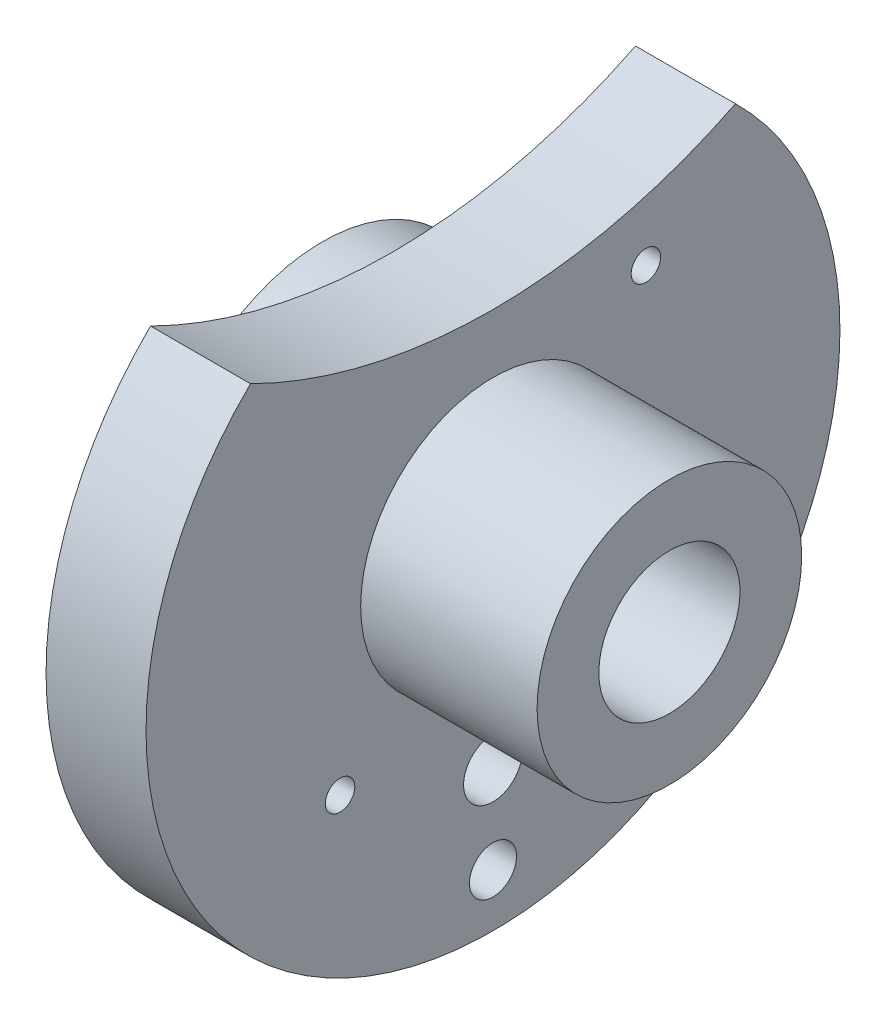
ISO-10303-21;
HEADER;
FILE_DESCRIPTION(('STEP AP214'),'2;1');
FILE_NAME('part.step','',(''),(''),'','','');
FILE_SCHEMA(('AUTOMOTIVE_DESIGN { 1 0 10303 214 1 1 1 1 }'));
ENDSEC;
DATA;
#1=APPLICATION_CONTEXT('core data for automotive mechanical design processes');
#2=APPLICATION_PROTOCOL_DEFINITION('international standard','automotive_design',2000,#1);
#3=PRODUCT_CONTEXT('',#1,'mechanical');
#4=PRODUCT('Part','Part','',(#3));
#5=PRODUCT_RELATED_PRODUCT_CATEGORY('part','',(#4));
#6=PRODUCT_DEFINITION_FORMATION('','',#4);
#7=PRODUCT_DEFINITION_CONTEXT('part definition',#1,'design');
#8=PRODUCT_DEFINITION('design','',#6,#7);
#9=PRODUCT_DEFINITION_SHAPE('','',#8);
#10=(LENGTH_UNIT() NAMED_UNIT(*) SI_UNIT(.MILLI.,.METRE.));
#11=(NAMED_UNIT(*) PLANE_ANGLE_UNIT() SI_UNIT($,.RADIAN.));
#12=(NAMED_UNIT(*) SI_UNIT($,.STERADIAN.) SOLID_ANGLE_UNIT());
#13=UNCERTAINTY_MEASURE_WITH_UNIT(LENGTH_MEASURE(1.E-05),#10,'distance_accuracy_value','');
#14=(GEOMETRIC_REPRESENTATION_CONTEXT(3) GLOBAL_UNCERTAINTY_ASSIGNED_CONTEXT((#13)) GLOBAL_UNIT_ASSIGNED_CONTEXT((#10,
#11,#12)) REPRESENTATION_CONTEXT('',''));
#15=CARTESIAN_POINT('',(0.,0.,0.));
#16=DIRECTION('',(0.,0.,1.));
#17=DIRECTION('',(1.,0.,0.));
#18=AXIS2_PLACEMENT_3D('',#15,#16,#17);
#19=CARTESIAN_POINT('',(-50.,0.,0.));
#20=DIRECTION('',(-1.,0.,0.));
#21=DIRECTION('',(0.,0.,1.));
#22=AXIS2_PLACEMENT_3D('',#19,#20,#21);
#23=CYLINDRICAL_SURFACE('',#22,24.);
#24=CARTESIAN_POINT('',(19.,0.,0.));
#25=DIRECTION('',(-1.,0.,0.));
#26=DIRECTION('',(0.,0.,1.));
#27=AXIS2_PLACEMENT_3D('',#24,#25,#26);
#28=CIRCLE('',#27,24.);
#29=CARTESIAN_POINT('',(19.,0.,24.));
#30=VERTEX_POINT('',#29);
#31=EDGE_CURVE('E63',#30,#30,#28,.T.);
#32=ORIENTED_EDGE('',*,*,#31,.F.);
#33=EDGE_LOOP('',(#32));
#34=FACE_BOUND('',#33,.T.);
#35=CARTESIAN_POINT('',(0.,0.,0.));
#36=DIRECTION('',(-1.,0.,0.));
#37=DIRECTION('',(0.,0.,1.));
#38=AXIS2_PLACEMENT_3D('',#35,#36,#37);
#39=CIRCLE('',#38,24.);
#40=CARTESIAN_POINT('',(0.,0.,24.));
#41=VERTEX_POINT('',#40);
#42=EDGE_CURVE('E40',#41,#41,#39,.T.);
#43=ORIENTED_EDGE('',*,*,#42,.T.);
#44=EDGE_LOOP('',(#43));
#45=FACE_BOUND('',#44,.T.);
#46=ADVANCED_FACE('F32',(#34,#45),#23,.F.);
#47=CARTESIAN_POINT('',(0.,24.,0.));
#48=DIRECTION('',(1.,0.,0.));
#49=DIRECTION('',(0.,0.,-1.));
#50=AXIS2_PLACEMENT_3D('',#47,#48,#49);
#51=PLANE('',#50);
#52=ORIENTED_EDGE('',*,*,#42,.F.);
#53=EDGE_LOOP('',(#52));
#54=FACE_BOUND('',#53,.T.);
#55=CARTESIAN_POINT('',(0.,0.,0.));
#56=DIRECTION('',(-1.,0.,0.));
#57=DIRECTION('',(0.,0.,1.));
#58=AXIS2_PLACEMENT_3D('',#55,#56,#57);
#59=CIRCLE('',#58,28.);
#60=CARTESIAN_POINT('',(0.,0.,28.));
#61=VERTEX_POINT('',#60);
#62=EDGE_CURVE('E76',#61,#61,#59,.T.);
#63=ORIENTED_EDGE('',*,*,#62,.T.);
#64=EDGE_LOOP('',(#63));
#65=FACE_BOUND('',#64,.T.);
#66=ADVANCED_FACE('F151',(#54,#65),#51,.F.);
#67=CARTESIAN_POINT('',(-50.,0.,0.));
#68=DIRECTION('',(-1.,0.,0.));
#69=DIRECTION('',(0.,0.,1.));
#70=AXIS2_PLACEMENT_3D('',#67,#68,#69);
#71=CYLINDRICAL_SURFACE('',#70,28.);
#72=ORIENTED_EDGE('',*,*,#62,.F.);
#73=EDGE_LOOP('',(#72));
#74=FACE_BOUND('',#73,.T.);
#75=CARTESIAN_POINT('',(12.,0.,0.));
#76=DIRECTION('',(-1.,0.,0.));
#77=DIRECTION('',(0.,0.,1.));
#78=AXIS2_PLACEMENT_3D('',#75,#76,#77);
#79=CIRCLE('',#78,28.);
#80=CARTESIAN_POINT('',(12.,0.,28.));
#81=VERTEX_POINT('',#80);
#82=EDGE_CURVE('E72',#81,#81,#79,.T.);
#83=ORIENTED_EDGE('',*,*,#82,.T.);
#84=EDGE_LOOP('',(#83));
#85=FACE_BOUND('',#84,.T.);
#86=ADVANCED_FACE('F156',(#74,#85),#71,.T.);
#87=CARTESIAN_POINT('',(12.,28.,0.));
#88=DIRECTION('',(1.,0.,0.));
#89=DIRECTION('',(0.,0.,-1.));
#90=AXIS2_PLACEMENT_3D('',#87,#88,#89);
#91=PLANE('',#90);
#92=CARTESIAN_POINT('',(12.,-26.,26.));
#93=DIRECTION('',(-1.,0.,0.));
#94=DIRECTION('',(0.,0.,1.));
#95=AXIS2_PLACEMENT_3D('',#92,#93,#94);
#96=CIRCLE('',#95,2.5);
#97=CARTESIAN_POINT('',(12.,-26.,28.5));
#98=VERTEX_POINT('',#97);
#99=EDGE_CURVE('E104',#98,#98,#96,.T.);
#100=ORIENTED_EDGE('',*,*,#99,.F.);
#101=EDGE_LOOP('',(#100));
#102=FACE_BOUND('',#101,.T.);
#103=CARTESIAN_POINT('',(12.,26.,-26.));
#104=DIRECTION('',(-1.,0.,0.));
#105=DIRECTION('',(0.,0.,1.));
#106=AXIS2_PLACEMENT_3D('',#103,#104,#105);
#107=CIRCLE('',#106,2.5);
#108=CARTESIAN_POINT('',(12.,26.,-23.5));
#109=VERTEX_POINT('',#108);
#110=EDGE_CURVE('E94',#109,#109,#107,.T.);
#111=ORIENTED_EDGE('',*,*,#110,.F.);
#112=EDGE_LOOP('',(#111));
#113=FACE_BOUND('',#112,.T.);
#114=CARTESIAN_POINT('',(12.,-50.,0.));
#115=DIRECTION('',(-1.,0.,0.));
#116=DIRECTION('',(0.,0.,1.));
#117=AXIS2_PLACEMENT_3D('',#114,#115,#116);
#118=CIRCLE('',#117,4.);
#119=CARTESIAN_POINT('',(12.,-50.,4.));
#120=VERTEX_POINT('',#119);
#121=EDGE_CURVE('E91',#120,#120,#118,.T.);
#122=ORIENTED_EDGE('',*,*,#121,.F.);
#123=EDGE_LOOP('',(#122));
#124=FACE_BOUND('',#123,.T.);
#125=CARTESIAN_POINT('',(12.,-35.,0.));
#126=DIRECTION('',(-1.,0.,0.));
#127=DIRECTION('',(0.,0.,1.));
#128=AXIS2_PLACEMENT_3D('',#125,#126,#127);
#129=CIRCLE('',#128,5.);
#130=CARTESIAN_POINT('',(12.,-35.,5.));
#131=VERTEX_POINT('',#130);
#132=EDGE_CURVE('E88',#131,#131,#129,.T.);
#133=ORIENTED_EDGE('',*,*,#132,.F.);
#134=EDGE_LOOP('',(#133));
#135=FACE_BOUND('',#134,.T.);
#136=ORIENTED_EDGE('',*,*,#82,.F.);
#137=EDGE_LOOP('',(#136));
#138=FACE_BOUND('',#137,.T.);
#139=CARTESIAN_POINT('',(12.,0.,0.));
#140=DIRECTION('',(-1.,0.,0.));
#141=DIRECTION('',(0.,0.,1.));
#142=AXIS2_PLACEMENT_3D('',#139,#140,#141);
#143=CIRCLE('',#142,59.);
#144=CARTESIAN_POINT('',(12.,42.199,-41.2340199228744));
#145=VERTEX_POINT('',#144);
#146=CARTESIAN_POINT('',(12.,42.199,41.2340199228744));
#147=VERTEX_POINT('',#146);
#148=EDGE_CURVE('E68',#145,#147,#143,.T.);
#149=ORIENTED_EDGE('',*,*,#148,.T.);
#150=CARTESIAN_POINT('',(12.,125.,0.));
#151=DIRECTION('',(-1.,0.,0.));
#152=DIRECTION('',(0.,0.,1.));
#153=AXIS2_PLACEMENT_3D('',#150,#151,#152);
#154=CIRCLE('',#153,92.5);
#155=EDGE_CURVE('E58',#145,#147,#154,.T.);
#156=ORIENTED_EDGE('',*,*,#155,.F.);
#157=EDGE_LOOP('',(#149,#156));
#158=FACE_BOUND('',#157,.T.);
#159=ADVANCED_FACE('F67',(#102,#113,#124,#135,#138,#158),#91,.F.);
#160=CARTESIAN_POINT('',(-50.,0.,0.));
#161=DIRECTION('',(-1.,0.,0.));
#162=DIRECTION('',(0.,0.,1.));
#163=AXIS2_PLACEMENT_3D('',#160,#161,#162);
#164=CYLINDRICAL_SURFACE('',#163,59.);
#165=ORIENTED_EDGE('',*,*,#148,.F.);
#166=DIRECTION('',(-1.,0.,0.));
#167=VECTOR('',#166,1.);
#168=CARTESIAN_POINT('',(35.5,42.199,-41.2340199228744));
#169=LINE('',#168,#167);
#170=CARTESIAN_POINT('',(29.,42.199,-41.2340199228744));
#171=VERTEX_POINT('',#170);
#172=EDGE_CURVE('E55',#145,#171,#169,.F.);
#173=ORIENTED_EDGE('',*,*,#172,.T.);
#174=CARTESIAN_POINT('',(29.,0.,0.));
#175=DIRECTION('',(-1.,0.,0.));
#176=DIRECTION('',(0.,0.,1.));
#177=AXIS2_PLACEMENT_3D('',#174,#175,#176);
#178=CIRCLE('',#177,59.);
#179=CARTESIAN_POINT('',(29.,42.199,41.2340199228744));
#180=VERTEX_POINT('',#179);
#181=EDGE_CURVE('E73',#171,#180,#178,.T.);
#182=ORIENTED_EDGE('',*,*,#181,.T.);
#183=DIRECTION('',(-1.,0.,0.));
#184=VECTOR('',#183,1.);
#185=CARTESIAN_POINT('',(35.5,42.199,41.2340199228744));
#186=LINE('',#185,#184);
#187=EDGE_CURVE('E48',#180,#147,#186,.T.);
#188=ORIENTED_EDGE('',*,*,#187,.T.);
#189=EDGE_LOOP('',(#165,#173,#182,#188));
#190=FACE_BOUND('',#189,.T.);
#191=ADVANCED_FACE('F71',(#190),#164,.T.);
#192=CARTESIAN_POINT('',(29.,59.,0.));
#193=DIRECTION('',(-1.,0.,0.));
#194=DIRECTION('',(0.,0.,1.));
#195=AXIS2_PLACEMENT_3D('',#192,#193,#194);
#196=PLANE('',#195);
#197=CARTESIAN_POINT('',(29.,-26.,26.));
#198=DIRECTION('',(-1.,0.,0.));
#199=DIRECTION('',(0.,0.,1.));
#200=AXIS2_PLACEMENT_3D('',#197,#198,#199);
#201=CIRCLE('',#200,2.5);
#202=CARTESIAN_POINT('',(29.,-26.,28.5));
#203=VERTEX_POINT('',#202);
#204=EDGE_CURVE('E35',#203,#203,#201,.T.);
#205=ORIENTED_EDGE('',*,*,#204,.T.);
#206=EDGE_LOOP('',(#205));
#207=FACE_BOUND('',#206,.T.);
#208=CARTESIAN_POINT('',(29.,26.,-26.));
#209=DIRECTION('',(-1.,0.,0.));
#210=DIRECTION('',(0.,0.,1.));
#211=AXIS2_PLACEMENT_3D('',#208,#209,#210);
#212=CIRCLE('',#211,2.5);
#213=CARTESIAN_POINT('',(29.,26.,-23.5));
#214=VERTEX_POINT('',#213);
#215=EDGE_CURVE('E92',#214,#214,#212,.T.);
#216=ORIENTED_EDGE('',*,*,#215,.T.);
#217=EDGE_LOOP('',(#216));
#218=FACE_BOUND('',#217,.T.);
#219=CARTESIAN_POINT('',(29.,-50.,0.));
#220=DIRECTION('',(-1.,0.,0.));
#221=DIRECTION('',(0.,0.,1.));
#222=AXIS2_PLACEMENT_3D('',#219,#220,#221);
#223=CIRCLE('',#222,4.);
#224=CARTESIAN_POINT('',(29.,-50.,4.));
#225=VERTEX_POINT('',#224);
#226=EDGE_CURVE('E89',#225,#225,#223,.T.);
#227=ORIENTED_EDGE('',*,*,#226,.T.);
#228=EDGE_LOOP('',(#227));
#229=FACE_BOUND('',#228,.T.);
#230=CARTESIAN_POINT('',(29.,-35.,0.));
#231=DIRECTION('',(-1.,0.,0.));
#232=DIRECTION('',(0.,0.,1.));
#233=AXIS2_PLACEMENT_3D('',#230,#231,#232);
#234=CIRCLE('',#233,5.);
#235=CARTESIAN_POINT('',(29.,-35.,5.));
#236=VERTEX_POINT('',#235);
#237=EDGE_CURVE('E69',#236,#236,#234,.T.);
#238=ORIENTED_EDGE('',*,*,#237,.T.);
#239=EDGE_LOOP('',(#238));
#240=FACE_BOUND('',#239,.T.);
#241=ORIENTED_EDGE('',*,*,#181,.F.);
#242=CARTESIAN_POINT('',(29.,125.,0.));
#243=DIRECTION('',(-1.,0.,0.));
#244=DIRECTION('',(0.,0.,1.));
#245=AXIS2_PLACEMENT_3D('',#242,#243,#244);
#246=CIRCLE('',#245,92.5);
#247=EDGE_CURVE('E11',#171,#180,#246,.T.);
#248=ORIENTED_EDGE('',*,*,#247,.T.);
#249=EDGE_LOOP('',(#241,#248));
#250=FACE_BOUND('',#249,.T.);
#251=CARTESIAN_POINT('',(29.,0.,0.));
#252=DIRECTION('',(-1.,0.,0.));
#253=DIRECTION('',(0.,0.,1.));
#254=AXIS2_PLACEMENT_3D('',#251,#252,#253);
#255=CIRCLE('',#254,22.5);
#256=CARTESIAN_POINT('',(29.,0.,22.5));
#257=VERTEX_POINT('',#256);
#258=EDGE_CURVE('E78',#257,#257,#255,.T.);
#259=ORIENTED_EDGE('',*,*,#258,.T.);
#260=EDGE_LOOP('',(#259));
#261=FACE_BOUND('',#260,.T.);
#262=ADVANCED_FACE('F123',(#207,#218,#229,#240,#250,#261),#196,.F.);
#263=CARTESIAN_POINT('',(-50.,0.,0.));
#264=DIRECTION('',(-1.,0.,0.));
#265=DIRECTION('',(0.,0.,1.));
#266=AXIS2_PLACEMENT_3D('',#263,#264,#265);
#267=CYLINDRICAL_SURFACE('',#266,22.5);
#268=ORIENTED_EDGE('',*,*,#258,.F.);
#269=EDGE_LOOP('',(#268));
#270=FACE_BOUND('',#269,.T.);
#271=CARTESIAN_POINT('',(59.,0.,0.));
#272=DIRECTION('',(-1.,0.,0.));
#273=DIRECTION('',(0.,0.,1.));
#274=AXIS2_PLACEMENT_3D('',#271,#272,#273);
#275=CIRCLE('',#274,22.5);
#276=CARTESIAN_POINT('',(59.,0.,22.5));
#277=VERTEX_POINT('',#276);
#278=EDGE_CURVE('E118',#277,#277,#275,.T.);
#279=ORIENTED_EDGE('',*,*,#278,.T.);
#280=EDGE_LOOP('',(#279));
#281=FACE_BOUND('',#280,.T.);
#282=ADVANCED_FACE('F125',(#270,#281),#267,.T.);
#283=CARTESIAN_POINT('',(59.,22.5,0.));
#284=DIRECTION('',(-1.,0.,0.));
#285=DIRECTION('',(0.,0.,1.));
#286=AXIS2_PLACEMENT_3D('',#283,#284,#285);
#287=PLANE('',#286);
#288=ORIENTED_EDGE('',*,*,#278,.F.);
#289=EDGE_LOOP('',(#288));
#290=FACE_BOUND('',#289,.T.);
#291=CARTESIAN_POINT('',(59.,0.,0.));
#292=DIRECTION('',(-1.,0.,0.));
#293=DIRECTION('',(0.,0.,1.));
#294=AXIS2_PLACEMENT_3D('',#291,#292,#293);
#295=CIRCLE('',#294,12.);
#296=CARTESIAN_POINT('',(59.,0.,12.));
#297=VERTEX_POINT('',#296);
#298=EDGE_CURVE('E115',#297,#297,#295,.T.);
#299=ORIENTED_EDGE('',*,*,#298,.T.);
#300=EDGE_LOOP('',(#299));
#301=FACE_BOUND('',#300,.T.);
#302=ADVANCED_FACE('F128',(#290,#301),#287,.F.);
#303=CARTESIAN_POINT('',(-50.,0.,0.));
#304=DIRECTION('',(-1.,0.,0.));
#305=DIRECTION('',(0.,0.,1.));
#306=AXIS2_PLACEMENT_3D('',#303,#304,#305);
#307=CYLINDRICAL_SURFACE('',#306,12.);
#308=ORIENTED_EDGE('',*,*,#298,.F.);
#309=EDGE_LOOP('',(#308));
#310=FACE_BOUND('',#309,.T.);
#311=CARTESIAN_POINT('',(19.,0.,0.));
#312=DIRECTION('',(-1.,0.,0.));
#313=DIRECTION('',(0.,0.,1.));
#314=AXIS2_PLACEMENT_3D('',#311,#312,#313);
#315=CIRCLE('',#314,12.);
#316=CARTESIAN_POINT('',(19.,0.,12.));
#317=VERTEX_POINT('',#316);
#318=EDGE_CURVE('E112',#317,#317,#315,.T.);
#319=ORIENTED_EDGE('',*,*,#318,.T.);
#320=EDGE_LOOP('',(#319));
#321=FACE_BOUND('',#320,.T.);
#322=ADVANCED_FACE('F134',(#310,#321),#307,.F.);
#323=CARTESIAN_POINT('',(19.,12.,0.));
#324=DIRECTION('',(1.,0.,0.));
#325=DIRECTION('',(0.,0.,-1.));
#326=AXIS2_PLACEMENT_3D('',#323,#324,#325);
#327=PLANE('',#326);
#328=ORIENTED_EDGE('',*,*,#318,.F.);
#329=EDGE_LOOP('',(#328));
#330=FACE_BOUND('',#329,.T.);
#331=ORIENTED_EDGE('',*,*,#31,.T.);
#332=EDGE_LOOP('',(#331));
#333=FACE_BOUND('',#332,.T.);
#334=ADVANCED_FACE('F140',(#330,#333),#327,.F.);
#335=CARTESIAN_POINT('',(59.,125.,0.));
#336=DIRECTION('',(-1.,0.,0.));
#337=DIRECTION('',(0.,0.,1.));
#338=AXIS2_PLACEMENT_3D('',#335,#336,#337);
#339=CYLINDRICAL_SURFACE('',#338,92.5);
#340=ORIENTED_EDGE('',*,*,#155,.T.);
#341=ORIENTED_EDGE('',*,*,#187,.F.);
#342=ORIENTED_EDGE('',*,*,#247,.F.);
#343=ORIENTED_EDGE('',*,*,#172,.F.);
#344=EDGE_LOOP('',(#340,#341,#342,#343));
#345=FACE_BOUND('',#344,.T.);
#346=ADVANCED_FACE('F57',(#345),#339,.F.);
#347=CARTESIAN_POINT('',(59.,-35.,0.));
#348=DIRECTION('',(-1.,0.,0.));
#349=DIRECTION('',(0.,0.,1.));
#350=AXIS2_PLACEMENT_3D('',#347,#348,#349);
#351=CYLINDRICAL_SURFACE('',#350,5.);
#352=ORIENTED_EDGE('',*,*,#132,.T.);
#353=EDGE_LOOP('',(#352));
#354=FACE_BOUND('',#353,.T.);
#355=ORIENTED_EDGE('',*,*,#237,.F.);
#356=EDGE_LOOP('',(#355));
#357=FACE_BOUND('',#356,.T.);
#358=ADVANCED_FACE('F179',(#354,#357),#351,.F.);
#359=CARTESIAN_POINT('',(59.,-50.,0.));
#360=DIRECTION('',(-1.,0.,0.));
#361=DIRECTION('',(0.,0.,1.));
#362=AXIS2_PLACEMENT_3D('',#359,#360,#361);
#363=CYLINDRICAL_SURFACE('',#362,4.);
#364=ORIENTED_EDGE('',*,*,#121,.T.);
#365=EDGE_LOOP('',(#364));
#366=FACE_BOUND('',#365,.T.);
#367=ORIENTED_EDGE('',*,*,#226,.F.);
#368=EDGE_LOOP('',(#367));
#369=FACE_BOUND('',#368,.T.);
#370=ADVANCED_FACE('F182',(#366,#369),#363,.F.);
#371=CARTESIAN_POINT('',(59.,26.,-26.));
#372=DIRECTION('',(-1.,0.,0.));
#373=DIRECTION('',(0.,0.,1.));
#374=AXIS2_PLACEMENT_3D('',#371,#372,#373);
#375=CYLINDRICAL_SURFACE('',#374,2.5);
#376=ORIENTED_EDGE('',*,*,#110,.T.);
#377=EDGE_LOOP('',(#376));
#378=FACE_BOUND('',#377,.T.);
#379=ORIENTED_EDGE('',*,*,#215,.F.);
#380=EDGE_LOOP('',(#379));
#381=FACE_BOUND('',#380,.T.);
#382=ADVANCED_FACE('F186',(#378,#381),#375,.F.);
#383=CARTESIAN_POINT('',(59.,-26.,26.));
#384=DIRECTION('',(-1.,0.,0.));
#385=DIRECTION('',(0.,0.,1.));
#386=AXIS2_PLACEMENT_3D('',#383,#384,#385);
#387=CYLINDRICAL_SURFACE('',#386,2.5);
#388=ORIENTED_EDGE('',*,*,#99,.T.);
#389=EDGE_LOOP('',(#388));
#390=FACE_BOUND('',#389,.T.);
#391=ORIENTED_EDGE('',*,*,#204,.F.);
#392=EDGE_LOOP('',(#391));
#393=FACE_BOUND('',#392,.T.);
#394=ADVANCED_FACE('F190',(#390,#393),#387,.F.);
#395=CLOSED_SHELL('',(#46,#66,#86,#159,#191,#262,#282,#302,#322,#334,#346,#358,#370,#382,#394));
#396=MANIFOLD_SOLID_BREP('B2',#395);
#397=ADVANCED_BREP_SHAPE_REPRESENTATION('',(#18,#396),#14);
#398=SHAPE_DEFINITION_REPRESENTATION(#9,#397);
ENDSEC;
END-ISO-10303-21;
